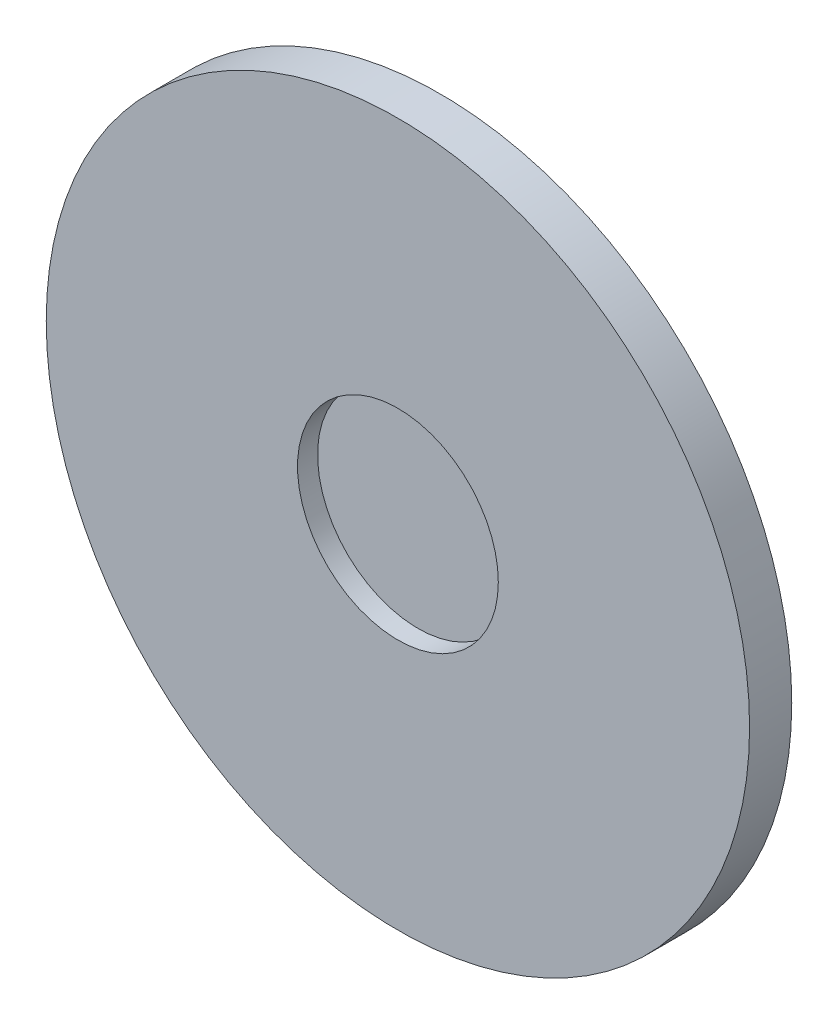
from build123d import *

# Parameters (mm, degrees)
SKETCH1_R          = 44.486071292
EXTRUDE1_DEPTH     = 5.334
SKETCH2_R          = 12.7
CUT_EXTRUDE1_DEPTH = 2.54


with BuildPart() as part:
    # Sketch1 → Extrude1 (new body)
    with BuildSketch(Plane.XY):
        Circle(SKETCH1_R)
    extrude(amount=EXTRUDE1_DEPTH)

    # Sketch2 → Cut-Extrude1 (cut)
    with BuildSketch(Plane.XY.offset(5.334)):
        Circle(SKETCH2_R)
    extrude(amount=-CUT_EXTRUDE1_DEPTH, mode=Mode.SUBTRACT)


solid = part.part
